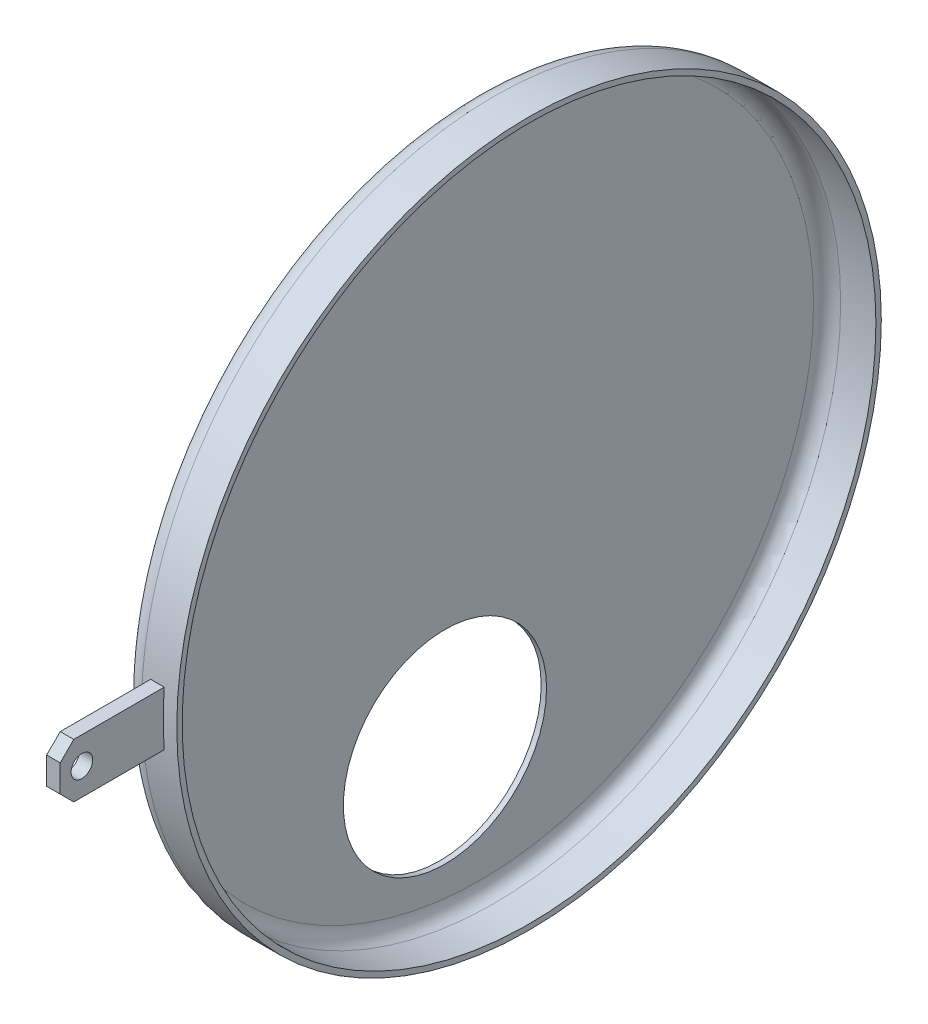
ISO-10303-21;
HEADER;
FILE_DESCRIPTION(('STEP AP214'),'2;1');
FILE_NAME('part.step','',(''),(''),'','','');
FILE_SCHEMA(('AUTOMOTIVE_DESIGN { 1 0 10303 214 1 1 1 1 }'));
ENDSEC;
DATA;
#1=APPLICATION_CONTEXT('core data for automotive mechanical design processes');
#2=APPLICATION_PROTOCOL_DEFINITION('international standard','automotive_design',2000,#1);
#3=PRODUCT_CONTEXT('',#1,'mechanical');
#4=PRODUCT('Part','Part','',(#3));
#5=PRODUCT_RELATED_PRODUCT_CATEGORY('part','',(#4));
#6=PRODUCT_DEFINITION_FORMATION('','',#4);
#7=PRODUCT_DEFINITION_CONTEXT('part definition',#1,'design');
#8=PRODUCT_DEFINITION('design','',#6,#7);
#9=PRODUCT_DEFINITION_SHAPE('','',#8);
#10=(LENGTH_UNIT() NAMED_UNIT(*) SI_UNIT(.MILLI.,.METRE.));
#11=(NAMED_UNIT(*) PLANE_ANGLE_UNIT() SI_UNIT($,.RADIAN.));
#12=(NAMED_UNIT(*) SI_UNIT($,.STERADIAN.) SOLID_ANGLE_UNIT());
#13=UNCERTAINTY_MEASURE_WITH_UNIT(LENGTH_MEASURE(1.E-05),#10,'distance_accuracy_value','');
#14=(GEOMETRIC_REPRESENTATION_CONTEXT(3) GLOBAL_UNCERTAINTY_ASSIGNED_CONTEXT((#13)) GLOBAL_UNIT_ASSIGNED_CONTEXT((#10,
#11,#12)) REPRESENTATION_CONTEXT('',''));
#15=CARTESIAN_POINT('',(0.,0.,0.));
#16=DIRECTION('',(0.,0.,1.));
#17=DIRECTION('',(1.,0.,0.));
#18=AXIS2_PLACEMENT_3D('',#15,#16,#17);
#19=CARTESIAN_POINT('',(50.,9.99999999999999,0.));
#20=DIRECTION('',(-1.,0.,0.));
#21=DIRECTION('',(0.,0.,1.));
#22=AXIS2_PLACEMENT_3D('',#19,#20,#21);
#23=PLANE('',#22);
#24=CARTESIAN_POINT('',(50.,-73.8605814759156,13.0236133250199));
#25=DIRECTION('',(-1.,0.,0.));
#26=DIRECTION('',(0.,0.,1.));
#27=AXIS2_PLACEMENT_3D('',#24,#25,#26);
#28=CIRCLE('',#27,37.5);
#29=CARTESIAN_POINT('',(50.,-73.8605814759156,50.5236133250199));
#30=VERTEX_POINT('',#29);
#31=EDGE_CURVE('E98',#30,#30,#28,.F.);
#32=ORIENTED_EDGE('',*,*,#31,.T.);
#33=EDGE_LOOP('',(#32));
#34=FACE_BOUND('',#33,.T.);
#35=CARTESIAN_POINT('',(50.,0.,0.));
#36=DIRECTION('',(1.,0.,0.));
#37=DIRECTION('',(0.,0.,-1.));
#38=AXIS2_PLACEMENT_3D('',#35,#36,#37);
#39=CIRCLE('',#38,9.99999999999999);
#40=CARTESIAN_POINT('',(50.,0.,-9.99999999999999));
#41=VERTEX_POINT('',#40);
#42=EDGE_CURVE('E144',#41,#41,#39,.T.);
#43=ORIENTED_EDGE('',*,*,#42,.T.);
#44=EDGE_LOOP('',(#43));
#45=FACE_BOUND('',#44,.T.);
#46=CARTESIAN_POINT('',(50.,0.,0.));
#47=DIRECTION('',(1.,0.,0.));
#48=DIRECTION('',(0.,0.,-1.));
#49=AXIS2_PLACEMENT_3D('',#46,#47,#48);
#50=CIRCLE('',#49,123.);
#51=CARTESIAN_POINT('',(50.,0.,-123.));
#52=VERTEX_POINT('',#51);
#53=EDGE_CURVE('E121',#52,#52,#50,.T.);
#54=ORIENTED_EDGE('',*,*,#53,.F.);
#55=EDGE_LOOP('',(#54));
#56=FACE_BOUND('',#55,.T.);
#57=ADVANCED_FACE('F33',(#34,#45,#56),#23,.T.);
#58=CARTESIAN_POINT('',(52.,0.,0.));
#59=DIRECTION('',(1.,0.,0.));
#60=DIRECTION('',(0.,0.,-1.));
#61=AXIS2_PLACEMENT_3D('',#58,#59,#60);
#62=CYLINDRICAL_SURFACE('',#61,9.99999999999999);
#63=CARTESIAN_POINT('',(0.,0.,0.));
#64=DIRECTION('',(1.,0.,0.));
#65=DIRECTION('',(0.,0.,-1.));
#66=AXIS2_PLACEMENT_3D('',#63,#64,#65);
#67=CIRCLE('',#66,9.99999999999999);
#68=CARTESIAN_POINT('',(0.,0.,-9.99999999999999));
#69=VERTEX_POINT('',#68);
#70=EDGE_CURVE('E141',#69,#69,#67,.T.);
#71=ORIENTED_EDGE('',*,*,#70,.T.);
#72=EDGE_LOOP('',(#71));
#73=FACE_BOUND('',#72,.T.);
#74=ORIENTED_EDGE('',*,*,#42,.F.);
#75=EDGE_LOOP('',(#74));
#76=FACE_BOUND('',#75,.T.);
#77=ADVANCED_FACE('F179',(#73,#76),#62,.T.);
#78=CARTESIAN_POINT('',(0.,0.,0.));
#79=DIRECTION('',(-1.,0.,0.));
#80=DIRECTION('',(0.,0.,1.));
#81=AXIS2_PLACEMENT_3D('',#78,#79,#80);
#82=PLANE('',#81);
#83=ORIENTED_EDGE('',*,*,#70,.F.);
#84=EDGE_LOOP('',(#83));
#85=FACE_BOUND('',#84,.T.);
#86=ADVANCED_FACE('F184',(#85),#82,.T.);
#87=CARTESIAN_POINT('',(52.,123.,0.));
#88=DIRECTION('',(1.,0.,0.));
#89=DIRECTION('',(0.,0.,-1.));
#90=AXIS2_PLACEMENT_3D('',#87,#88,#89);
#91=PLANE('',#90);
#92=CARTESIAN_POINT('',(52.,-73.8605814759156,13.0236133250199));
#93=DIRECTION('',(1.,0.,0.));
#94=DIRECTION('',(0.,0.,-1.));
#95=AXIS2_PLACEMENT_3D('',#92,#93,#94);
#96=CIRCLE('',#95,37.5);
#97=CARTESIAN_POINT('',(52.,-73.8605814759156,-24.4763866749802));
#98=VERTEX_POINT('',#97);
#99=EDGE_CURVE('E118',#98,#98,#96,.T.);
#100=ORIENTED_EDGE('',*,*,#99,.F.);
#101=EDGE_LOOP('',(#100));
#102=FACE_BOUND('',#101,.T.);
#103=CARTESIAN_POINT('',(52.,0.,0.));
#104=DIRECTION('',(1.,0.,0.));
#105=DIRECTION('',(0.,0.,-1.));
#106=AXIS2_PLACEMENT_3D('',#103,#104,#105);
#107=CIRCLE('',#106,123.);
#108=CARTESIAN_POINT('',(52.,0.,-123.));
#109=VERTEX_POINT('',#108);
#110=EDGE_CURVE('E138',#109,#109,#107,.T.);
#111=ORIENTED_EDGE('',*,*,#110,.T.);
#112=EDGE_LOOP('',(#111));
#113=FACE_BOUND('',#112,.T.);
#114=ADVANCED_FACE('F218',(#102,#113),#91,.T.);
#115=CARTESIAN_POINT('',(57.,0.,0.));
#116=DIRECTION('',(1.,0.,0.));
#117=DIRECTION('',(0.,0.,-1.));
#118=AXIS2_PLACEMENT_3D('',#115,#116,#117);
#119=TOROIDAL_SURFACE('',#118,123.,5.);
#120=CARTESIAN_POINT('',(57.,0.,0.));
#121=DIRECTION('',(1.,0.,0.));
#122=DIRECTION('',(0.,0.,-1.));
#123=AXIS2_PLACEMENT_3D('',#120,#121,#122);
#124=CIRCLE('',#123,128.);
#125=CARTESIAN_POINT('',(57.,0.,-128.));
#126=VERTEX_POINT('',#125);
#127=EDGE_CURVE('E135',#126,#126,#124,.T.);
#128=ORIENTED_EDGE('',*,*,#127,.T.);
#129=EDGE_LOOP('',(#128));
#130=FACE_BOUND('',#129,.T.);
#131=ORIENTED_EDGE('',*,*,#110,.F.);
#132=EDGE_LOOP('',(#131));
#133=FACE_BOUND('',#132,.T.);
#134=ADVANCED_FACE('F212',(#130,#133),#119,.F.);
#135=CARTESIAN_POINT('',(52.,0.,0.));
#136=DIRECTION('',(1.,0.,0.));
#137=DIRECTION('',(0.,0.,-1.));
#138=AXIS2_PLACEMENT_3D('',#135,#136,#137);
#139=CYLINDRICAL_SURFACE('',#138,128.);
#140=CARTESIAN_POINT('',(70.,0.,0.));
#141=DIRECTION('',(1.,0.,0.));
#142=DIRECTION('',(0.,0.,-1.));
#143=AXIS2_PLACEMENT_3D('',#140,#141,#142);
#144=CIRCLE('',#143,128.);
#145=CARTESIAN_POINT('',(70.,0.,-128.));
#146=VERTEX_POINT('',#145);
#147=EDGE_CURVE('E132',#146,#146,#144,.T.);
#148=ORIENTED_EDGE('',*,*,#147,.T.);
#149=EDGE_LOOP('',(#148));
#150=FACE_BOUND('',#149,.T.);
#151=ORIENTED_EDGE('',*,*,#127,.F.);
#152=EDGE_LOOP('',(#151));
#153=FACE_BOUND('',#152,.T.);
#154=ADVANCED_FACE('F206',(#150,#153),#139,.F.);
#155=CARTESIAN_POINT('',(70.,130.,0.));
#156=DIRECTION('',(1.,0.,0.));
#157=DIRECTION('',(0.,0.,-1.));
#158=AXIS2_PLACEMENT_3D('',#155,#156,#157);
#159=PLANE('',#158);
#160=CARTESIAN_POINT('',(70.,0.,0.));
#161=DIRECTION('',(1.,0.,0.));
#162=DIRECTION('',(0.,0.,-1.));
#163=AXIS2_PLACEMENT_3D('',#160,#161,#162);
#164=CIRCLE('',#163,130.);
#165=CARTESIAN_POINT('',(70.,0.,-130.));
#166=VERTEX_POINT('',#165);
#167=EDGE_CURVE('E129',#166,#166,#164,.T.);
#168=ORIENTED_EDGE('',*,*,#167,.T.);
#169=EDGE_LOOP('',(#168));
#170=FACE_BOUND('',#169,.T.);
#171=ORIENTED_EDGE('',*,*,#147,.F.);
#172=EDGE_LOOP('',(#171));
#173=FACE_BOUND('',#172,.T.);
#174=ADVANCED_FACE('F200',(#170,#173),#159,.T.);
#175=CARTESIAN_POINT('',(52.,0.,0.));
#176=DIRECTION('',(1.,0.,0.));
#177=DIRECTION('',(0.,0.,-1.));
#178=AXIS2_PLACEMENT_3D('',#175,#176,#177);
#179=CYLINDRICAL_SURFACE('',#178,130.);
#180=CARTESIAN_POINT('',(60.,0.,0.));
#181=DIRECTION('',(-1.,0.,0.));
#182=DIRECTION('',(0.,0.,1.));
#183=AXIS2_PLACEMENT_3D('',#180,#181,#182);
#184=CIRCLE('',#183,130.);
#185=CARTESIAN_POINT('',(60.,-10.,129.614813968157));
#186=VERTEX_POINT('',#185);
#187=CARTESIAN_POINT('',(60.,10.,129.614813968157));
#188=VERTEX_POINT('',#187);
#189=EDGE_CURVE('E86',#186,#188,#184,.T.);
#190=ORIENTED_EDGE('',*,*,#189,.T.);
#191=DIRECTION('',(1.,0.,0.));
#192=VECTOR('',#191,1.);
#193=CARTESIAN_POINT('',(52.,10.,129.614813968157));
#194=LINE('',#193,#192);
#195=CARTESIAN_POINT('',(65.,10.,129.614813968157));
#196=VERTEX_POINT('',#195);
#197=EDGE_CURVE('E90',#188,#196,#194,.T.);
#198=ORIENTED_EDGE('',*,*,#197,.T.);
#199=CARTESIAN_POINT('',(65.,0.,0.));
#200=DIRECTION('',(1.,0.,0.));
#201=DIRECTION('',(0.,0.,-1.));
#202=AXIS2_PLACEMENT_3D('',#199,#200,#201);
#203=CIRCLE('',#202,130.);
#204=CARTESIAN_POINT('',(65.,-10.,129.614813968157));
#205=VERTEX_POINT('',#204);
#206=EDGE_CURVE('E103',#196,#205,#203,.T.);
#207=ORIENTED_EDGE('',*,*,#206,.T.);
#208=DIRECTION('',(1.,0.,0.));
#209=VECTOR('',#208,1.);
#210=CARTESIAN_POINT('',(52.,-10.,129.614813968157));
#211=LINE('',#210,#209);
#212=EDGE_CURVE('E93',#205,#186,#211,.F.);
#213=ORIENTED_EDGE('',*,*,#212,.T.);
#214=EDGE_LOOP('',(#190,#198,#207,#213));
#215=FACE_BOUND('',#214,.T.);
#216=CARTESIAN_POINT('',(57.,0.,0.));
#217=DIRECTION('',(1.,0.,0.));
#218=DIRECTION('',(0.,0.,-1.));
#219=AXIS2_PLACEMENT_3D('',#216,#217,#218);
#220=CIRCLE('',#219,130.);
#221=CARTESIAN_POINT('',(57.,0.,-130.));
#222=VERTEX_POINT('',#221);
#223=EDGE_CURVE('E126',#222,#222,#220,.T.);
#224=ORIENTED_EDGE('',*,*,#223,.T.);
#225=EDGE_LOOP('',(#224));
#226=FACE_BOUND('',#225,.T.);
#227=ORIENTED_EDGE('',*,*,#167,.F.);
#228=EDGE_LOOP('',(#227));
#229=FACE_BOUND('',#228,.T.);
#230=ADVANCED_FACE('F88',(#215,#226,#229),#179,.T.);
#231=CARTESIAN_POINT('',(57.,0.,0.));
#232=DIRECTION('',(1.,0.,0.));
#233=DIRECTION('',(0.,0.,-1.));
#234=AXIS2_PLACEMENT_3D('',#231,#232,#233);
#235=TOROIDAL_SURFACE('',#234,123.,7.);
#236=ORIENTED_EDGE('',*,*,#53,.T.);
#237=EDGE_LOOP('',(#236));
#238=FACE_BOUND('',#237,.T.);
#239=ORIENTED_EDGE('',*,*,#223,.F.);
#240=EDGE_LOOP('',(#239));
#241=FACE_BOUND('',#240,.T.);
#242=ADVANCED_FACE('F192',(#238,#241),#235,.T.);
#243=CARTESIAN_POINT('',(-0.001000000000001,-73.8605814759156,13.0236133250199));
#244=DIRECTION('',(1.,0.,0.));
#245=DIRECTION('',(0.,0.,-1.));
#246=AXIS2_PLACEMENT_3D('',#243,#244,#245);
#247=CYLINDRICAL_SURFACE('',#246,37.5);
#248=ORIENTED_EDGE('',*,*,#31,.F.);
#249=EDGE_LOOP('',(#248));
#250=FACE_BOUND('',#249,.T.);
#251=ORIENTED_EDGE('',*,*,#99,.T.);
#252=EDGE_LOOP('',(#251));
#253=FACE_BOUND('',#252,.T.);
#254=ADVANCED_FACE('F195',(#250,#253),#247,.F.);
#255=CARTESIAN_POINT('',(65.,10.,168.));
#256=DIRECTION('',(0.,0.,-1.));
#257=DIRECTION('',(-1.,0.,0.));
#258=AXIS2_PLACEMENT_3D('',#255,#256,#257);
#259=PLANE('',#258);
#260=DIRECTION('',(0.,1.,0.));
#261=VECTOR('',#260,1.);
#262=CARTESIAN_POINT('',(65.,10.,168.));
#263=LINE('',#262,#261);
#264=CARTESIAN_POINT('',(65.,-5.00000000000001,168.));
#265=VERTEX_POINT('',#264);
#266=CARTESIAN_POINT('',(65.,4.99999999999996,168.));
#267=VERTEX_POINT('',#266);
#268=EDGE_CURVE('E109',#265,#267,#263,.T.);
#269=ORIENTED_EDGE('',*,*,#268,.T.);
#270=DIRECTION('',(-1.,0.,0.));
#271=VECTOR('',#270,1.);
#272=CARTESIAN_POINT('',(60.,5.,168.));
#273=LINE('',#272,#271);
#274=CARTESIAN_POINT('',(60.,4.99999999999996,168.));
#275=VERTEX_POINT('',#274);
#276=EDGE_CURVE('E150',#267,#275,#273,.T.);
#277=ORIENTED_EDGE('',*,*,#276,.T.);
#278=DIRECTION('',(0.,-1.,0.));
#279=VECTOR('',#278,1.);
#280=CARTESIAN_POINT('',(60.,10.,168.));
#281=LINE('',#280,#279);
#282=CARTESIAN_POINT('',(60.,-5.00000000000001,168.));
#283=VERTEX_POINT('',#282);
#284=EDGE_CURVE('E114',#275,#283,#281,.T.);
#285=ORIENTED_EDGE('',*,*,#284,.T.);
#286=DIRECTION('',(1.,0.,0.));
#287=VECTOR('',#286,1.);
#288=CARTESIAN_POINT('',(65.,-4.99999999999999,168.));
#289=LINE('',#288,#287);
#290=EDGE_CURVE('E147',#283,#265,#289,.T.);
#291=ORIENTED_EDGE('',*,*,#290,.T.);
#292=EDGE_LOOP('',(#269,#277,#285,#291));
#293=FACE_BOUND('',#292,.T.);
#294=ADVANCED_FACE('F162',(#293),#259,.F.);
#295=CARTESIAN_POINT('',(60.,10.,-130.001));
#296=DIRECTION('',(-1.,0.,0.));
#297=DIRECTION('',(0.,0.,1.));
#298=AXIS2_PLACEMENT_3D('',#295,#296,#297);
#299=PLANE('',#298);
#300=CARTESIAN_POINT('',(60.,0.,160.));
#301=DIRECTION('',(-1.,0.,0.));
#302=DIRECTION('',(0.,0.,1.));
#303=AXIS2_PLACEMENT_3D('',#300,#301,#302);
#304=CIRCLE('',#303,3.99999999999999);
#305=CARTESIAN_POINT('',(60.,0.,164.));
#306=VERTEX_POINT('',#305);
#307=EDGE_CURVE('E354',#306,#306,#304,.T.);
#308=ORIENTED_EDGE('',*,*,#307,.F.);
#309=EDGE_LOOP('',(#308));
#310=FACE_BOUND('',#309,.T.);
#311=ORIENTED_EDGE('',*,*,#284,.F.);
#312=DIRECTION('',(0.,0.707106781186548,-0.707106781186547));
#313=VECTOR('',#312,1.);
#314=CARTESIAN_POINT('',(60.,156.5005,16.4995000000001));
#315=LINE('',#314,#313);
#316=CARTESIAN_POINT('',(60.,10.,163.));
#317=VERTEX_POINT('',#316);
#318=EDGE_CURVE('E107',#275,#317,#315,.T.);
#319=ORIENTED_EDGE('',*,*,#318,.T.);
#320=DIRECTION('',(0.,0.,1.));
#321=VECTOR('',#320,1.);
#322=CARTESIAN_POINT('',(60.,10.,-130.001));
#323=LINE('',#322,#321);
#324=EDGE_CURVE('E101',#188,#317,#323,.T.);
#325=ORIENTED_EDGE('',*,*,#324,.F.);
#326=ORIENTED_EDGE('',*,*,#189,.F.);
#327=DIRECTION('',(0.,0.,1.));
#328=VECTOR('',#327,1.);
#329=CARTESIAN_POINT('',(60.,-10.,-130.001));
#330=LINE('',#329,#328);
#331=CARTESIAN_POINT('',(60.,-10.,163.));
#332=VERTEX_POINT('',#331);
#333=EDGE_CURVE('E108',#186,#332,#330,.T.);
#334=ORIENTED_EDGE('',*,*,#333,.T.);
#335=DIRECTION('',(0.,0.707106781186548,0.707106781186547));
#336=VECTOR('',#335,1.);
#337=CARTESIAN_POINT('',(60.,-146.5005,26.4995000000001));
#338=LINE('',#337,#336);
#339=EDGE_CURVE('E153',#332,#283,#338,.T.);
#340=ORIENTED_EDGE('',*,*,#339,.T.);
#341=EDGE_LOOP('',(#311,#319,#325,#326,#334,#340));
#342=FACE_BOUND('',#341,.T.);
#343=ADVANCED_FACE('F106',(#310,#342),#299,.T.);
#344=CARTESIAN_POINT('',(60.,-10.,-130.001));
#345=DIRECTION('',(0.,-1.,0.));
#346=DIRECTION('',(1.,0.,0.));
#347=AXIS2_PLACEMENT_3D('',#344,#345,#346);
#348=PLANE('',#347);
#349=DIRECTION('',(0.,0.,1.));
#350=VECTOR('',#349,1.);
#351=CARTESIAN_POINT('',(65.,-10.,-130.001));
#352=LINE('',#351,#350);
#353=CARTESIAN_POINT('',(65.,-10.,163.));
#354=VERTEX_POINT('',#353);
#355=EDGE_CURVE('E111',#205,#354,#352,.T.);
#356=ORIENTED_EDGE('',*,*,#355,.T.);
#357=DIRECTION('',(-1.,0.,0.));
#358=VECTOR('',#357,1.);
#359=CARTESIAN_POINT('',(60.,-10.,163.));
#360=LINE('',#359,#358);
#361=EDGE_CURVE('E11',#354,#332,#360,.T.);
#362=ORIENTED_EDGE('',*,*,#361,.T.);
#363=ORIENTED_EDGE('',*,*,#333,.F.);
#364=ORIENTED_EDGE('',*,*,#212,.F.);
#365=EDGE_LOOP('',(#356,#362,#363,#364));
#366=FACE_BOUND('',#365,.T.);
#367=ADVANCED_FACE('F239',(#366),#348,.T.);
#368=CARTESIAN_POINT('',(65.,10.,-130.001));
#369=DIRECTION('',(1.,0.,0.));
#370=DIRECTION('',(0.,0.,-1.));
#371=AXIS2_PLACEMENT_3D('',#368,#369,#370);
#372=PLANE('',#371);
#373=CARTESIAN_POINT('',(65.,0.,160.));
#374=DIRECTION('',(1.,0.,0.));
#375=DIRECTION('',(0.,0.,-1.));
#376=AXIS2_PLACEMENT_3D('',#373,#374,#375);
#377=CIRCLE('',#376,3.99999999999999);
#378=CARTESIAN_POINT('',(65.,0.,156.));
#379=VERTEX_POINT('',#378);
#380=EDGE_CURVE('E352',#379,#379,#377,.T.);
#381=ORIENTED_EDGE('',*,*,#380,.F.);
#382=EDGE_LOOP('',(#381));
#383=FACE_BOUND('',#382,.T.);
#384=DIRECTION('',(0.,0.,1.));
#385=VECTOR('',#384,1.);
#386=CARTESIAN_POINT('',(65.,10.,-130.001));
#387=LINE('',#386,#385);
#388=CARTESIAN_POINT('',(65.,10.,163.));
#389=VERTEX_POINT('',#388);
#390=EDGE_CURVE('E102',#196,#389,#387,.T.);
#391=ORIENTED_EDGE('',*,*,#390,.T.);
#392=DIRECTION('',(0.,-0.707106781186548,0.707106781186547));
#393=VECTOR('',#392,1.);
#394=CARTESIAN_POINT('',(65.,156.5005,16.4995000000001));
#395=LINE('',#394,#393);
#396=EDGE_CURVE('E40',#389,#267,#395,.T.);
#397=ORIENTED_EDGE('',*,*,#396,.T.);
#398=ORIENTED_EDGE('',*,*,#268,.F.);
#399=DIRECTION('',(0.,-0.707106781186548,-0.707106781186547));
#400=VECTOR('',#399,1.);
#401=CARTESIAN_POINT('',(65.,-146.5005,26.4995000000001));
#402=LINE('',#401,#400);
#403=EDGE_CURVE('E47',#265,#354,#402,.T.);
#404=ORIENTED_EDGE('',*,*,#403,.T.);
#405=ORIENTED_EDGE('',*,*,#355,.F.);
#406=ORIENTED_EDGE('',*,*,#206,.F.);
#407=EDGE_LOOP('',(#391,#397,#398,#404,#405,#406));
#408=FACE_BOUND('',#407,.T.);
#409=ADVANCED_FACE('F158',(#383,#408),#372,.T.);
#410=CARTESIAN_POINT('',(60.,10.,-130.001));
#411=DIRECTION('',(0.,1.,0.));
#412=DIRECTION('',(-1.,0.,0.));
#413=AXIS2_PLACEMENT_3D('',#410,#411,#412);
#414=PLANE('',#413);
#415=ORIENTED_EDGE('',*,*,#324,.T.);
#416=DIRECTION('',(1.,0.,0.));
#417=VECTOR('',#416,1.);
#418=CARTESIAN_POINT('',(65.,10.,163.));
#419=LINE('',#418,#417);
#420=EDGE_CURVE('E55',#317,#389,#419,.T.);
#421=ORIENTED_EDGE('',*,*,#420,.T.);
#422=ORIENTED_EDGE('',*,*,#390,.F.);
#423=ORIENTED_EDGE('',*,*,#197,.F.);
#424=EDGE_LOOP('',(#415,#421,#422,#423));
#425=FACE_BOUND('',#424,.T.);
#426=ADVANCED_FACE('F100',(#425),#414,.T.);
#427=CARTESIAN_POINT('',(0.,0.,160.));
#428=DIRECTION('',(1.,0.,0.));
#429=DIRECTION('',(0.,0.,-1.));
#430=AXIS2_PLACEMENT_3D('',#427,#428,#429);
#431=CYLINDRICAL_SURFACE('',#430,3.99999999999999);
#432=ORIENTED_EDGE('',*,*,#307,.T.);
#433=EDGE_LOOP('',(#432));
#434=FACE_BOUND('',#433,.T.);
#435=ORIENTED_EDGE('',*,*,#380,.T.);
#436=EDGE_LOOP('',(#435));
#437=FACE_BOUND('',#436,.T.);
#438=ADVANCED_FACE('F168',(#434,#437),#431,.F.);
#439=CARTESIAN_POINT('',(65.,4.99999999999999,168.));
#440=DIRECTION('',(0.,0.707106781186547,0.707106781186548));
#441=DIRECTION('',(0.,-0.707106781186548,0.707106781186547));
#442=AXIS2_PLACEMENT_3D('',#439,#440,#441);
#443=PLANE('',#442);
#444=ORIENTED_EDGE('',*,*,#396,.F.);
#445=ORIENTED_EDGE('',*,*,#420,.F.);
#446=ORIENTED_EDGE('',*,*,#318,.F.);
#447=ORIENTED_EDGE('',*,*,#276,.F.);
#448=EDGE_LOOP('',(#444,#445,#446,#447));
#449=FACE_BOUND('',#448,.T.);
#450=ADVANCED_FACE('F165',(#449),#443,.T.);
#451=CARTESIAN_POINT('',(65.,-4.99999999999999,168.));
#452=DIRECTION('',(0.,-0.707106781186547,0.707106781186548));
#453=DIRECTION('',(0.,-0.707106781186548,-0.707106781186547));
#454=AXIS2_PLACEMENT_3D('',#451,#452,#453);
#455=PLANE('',#454);
#456=ORIENTED_EDGE('',*,*,#339,.F.);
#457=ORIENTED_EDGE('',*,*,#361,.F.);
#458=ORIENTED_EDGE('',*,*,#403,.F.);
#459=ORIENTED_EDGE('',*,*,#290,.F.);
#460=EDGE_LOOP('',(#456,#457,#458,#459));
#461=FACE_BOUND('',#460,.T.);
#462=ADVANCED_FACE('F167',(#461),#455,.T.);
#463=CLOSED_SHELL('',(#57,#77,#86,#114,#134,#154,#174,#230,#242,#254,#294,#343,#367,#409,#426,
#438,#450,#462));
#464=MANIFOLD_SOLID_BREP('B2',#463);
#465=ADVANCED_BREP_SHAPE_REPRESENTATION('',(#18,#464),#14);
#466=SHAPE_DEFINITION_REPRESENTATION(#9,#465);
ENDSEC;
END-ISO-10303-21;
